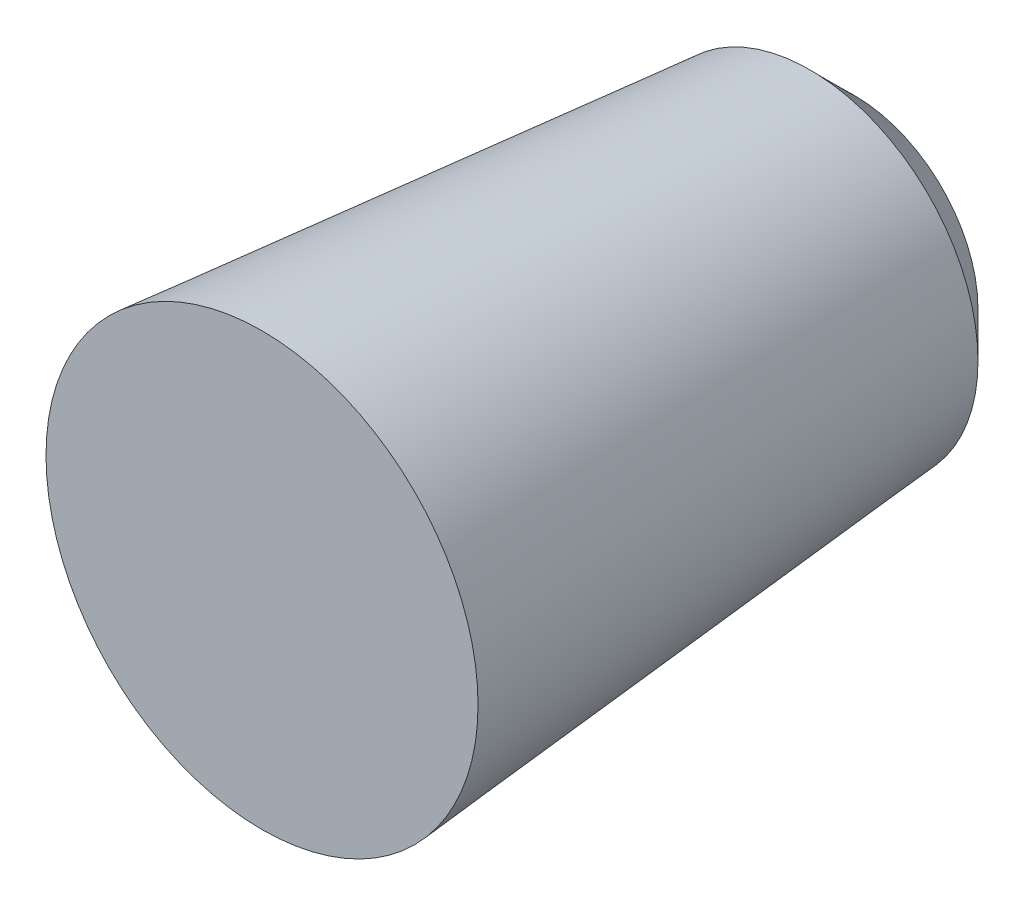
ISO-10303-21;
HEADER;
FILE_DESCRIPTION(('STEP AP214'),'2;1');
FILE_NAME('part.step','',(''),(''),'','','');
FILE_SCHEMA(('AUTOMOTIVE_DESIGN { 1 0 10303 214 1 1 1 1 }'));
ENDSEC;
DATA;
#1=APPLICATION_CONTEXT('core data for automotive mechanical design processes');
#2=APPLICATION_PROTOCOL_DEFINITION('international standard','automotive_design',2000,#1);
#3=PRODUCT_CONTEXT('',#1,'mechanical');
#4=PRODUCT('Part','Part','',(#3));
#5=PRODUCT_RELATED_PRODUCT_CATEGORY('part','',(#4));
#6=PRODUCT_DEFINITION_FORMATION('','',#4);
#7=PRODUCT_DEFINITION_CONTEXT('part definition',#1,'design');
#8=PRODUCT_DEFINITION('design','',#6,#7);
#9=PRODUCT_DEFINITION_SHAPE('','',#8);
#10=(LENGTH_UNIT() NAMED_UNIT(*) SI_UNIT(.MILLI.,.METRE.));
#11=(NAMED_UNIT(*) PLANE_ANGLE_UNIT() SI_UNIT($,.RADIAN.));
#12=(NAMED_UNIT(*) SI_UNIT($,.STERADIAN.) SOLID_ANGLE_UNIT());
#13=UNCERTAINTY_MEASURE_WITH_UNIT(LENGTH_MEASURE(1.E-05),#10,'distance_accuracy_value','');
#14=(GEOMETRIC_REPRESENTATION_CONTEXT(3) GLOBAL_UNCERTAINTY_ASSIGNED_CONTEXT((#13)) GLOBAL_UNIT_ASSIGNED_CONTEXT((#10,
#11,#12)) REPRESENTATION_CONTEXT('',''));
#15=CARTESIAN_POINT('',(0.,0.,0.));
#16=DIRECTION('',(0.,0.,1.));
#17=DIRECTION('',(1.,0.,0.));
#18=AXIS2_PLACEMENT_3D('',#15,#16,#17);
#19=CARTESIAN_POINT('',(32.0604523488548,-76.1769470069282,0.));
#20=DIRECTION('',(0.,0.,1.));
#21=DIRECTION('',(1.,0.,0.));
#22=AXIS2_PLACEMENT_3D('',#19,#20,#21);
#23=CONICAL_SURFACE('',#22,24.,0.0872664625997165);
#24=CARTESIAN_POINT('',(32.0604523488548,-76.1769470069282,6.5752607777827));
#25=DIRECTION('',(0.,0.,-1.));
#26=DIRECTION('',(-1.,0.,0.));
#27=AXIS2_PLACEMENT_3D('',#24,#25,#26);
#28=CIRCLE('',#27,24.5752607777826);
#29=CARTESIAN_POINT('',(7.48519157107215,-76.1769470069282,6.5752607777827));
#30=VERTEX_POINT('',#29);
#31=EDGE_CURVE('E38',#30,#30,#28,.F.);
#32=ORIENTED_EDGE('',*,*,#31,.T.);
#33=EDGE_LOOP('',(#32));
#34=FACE_BOUND('',#33,.T.);
#35=CARTESIAN_POINT('',(32.0604523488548,-76.1769470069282,86.6813627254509));
#36=DIRECTION('',(0.,0.,1.));
#37=DIRECTION('',(1.,0.,0.));
#38=AXIS2_PLACEMENT_3D('',#35,#36,#37);
#39=CIRCLE('',#38,31.5836365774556);
#40=CARTESIAN_POINT('',(63.6440889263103,-76.1769470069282,86.6813627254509));
#41=VERTEX_POINT('',#40);
#42=EDGE_CURVE('E42',#41,#41,#39,.T.);
#43=ORIENTED_EDGE('',*,*,#42,.F.);
#44=EDGE_LOOP('',(#43));
#45=FACE_BOUND('',#44,.T.);
#46=ADVANCED_FACE('F31',(#34,#45),#23,.T.);
#47=CARTESIAN_POINT('',(32.0604523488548,-76.1769470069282,0.));
#48=DIRECTION('',(0.,0.,1.));
#49=DIRECTION('',(1.,0.,0.));
#50=AXIS2_PLACEMENT_3D('',#47,#48,#49);
#51=PLANE('',#50);
#52=CARTESIAN_POINT('',(32.0604523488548,-76.1769470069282,0.));
#53=DIRECTION('',(0.,0.,1.));
#54=DIRECTION('',(1.,0.,0.));
#55=AXIS2_PLACEMENT_3D('',#52,#53,#54);
#56=CIRCLE('',#55,18.);
#57=CARTESIAN_POINT('',(50.0604523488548,-76.1769470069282,0.));
#58=VERTEX_POINT('',#57);
#59=EDGE_CURVE('E10',#58,#58,#56,.F.);
#60=ORIENTED_EDGE('',*,*,#59,.T.);
#61=EDGE_LOOP('',(#60));
#62=FACE_BOUND('',#61,.T.);
#63=ADVANCED_FACE('F52',(#62),#51,.F.);
#64=CARTESIAN_POINT('',(0.,0.,86.6813627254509));
#65=DIRECTION('',(0.,0.,1.));
#66=DIRECTION('',(1.,0.,0.));
#67=AXIS2_PLACEMENT_3D('',#64,#65,#66);
#68=PLANE('',#67);
#69=ORIENTED_EDGE('',*,*,#42,.T.);
#70=EDGE_LOOP('',(#69));
#71=FACE_BOUND('',#70,.T.);
#72=ADVANCED_FACE('F49',(#71),#68,.T.);
#73=CARTESIAN_POINT('',(32.0604523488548,-76.1769470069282,6.57526077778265));
#74=DIRECTION('',(0.,0.,1.));
#75=DIRECTION('',(1.,0.,0.));
#76=AXIS2_PLACEMENT_3D('',#73,#74,#75);
#77=CONICAL_SURFACE('',#76,24.5752607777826,0.785398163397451);
#78=ORIENTED_EDGE('',*,*,#59,.F.);
#79=EDGE_LOOP('',(#78));
#80=FACE_BOUND('',#79,.T.);
#81=ORIENTED_EDGE('',*,*,#31,.F.);
#82=EDGE_LOOP('',(#81));
#83=FACE_BOUND('',#82,.T.);
#84=ADVANCED_FACE('F33',(#80,#83),#77,.T.);
#85=CLOSED_SHELL('',(#46,#63,#72,#84));
#86=MANIFOLD_SOLID_BREP('B2',#85);
#87=ADVANCED_BREP_SHAPE_REPRESENTATION('',(#18,#86),#14);
#88=SHAPE_DEFINITION_REPRESENTATION(#9,#87);
ENDSEC;
END-ISO-10303-21;
